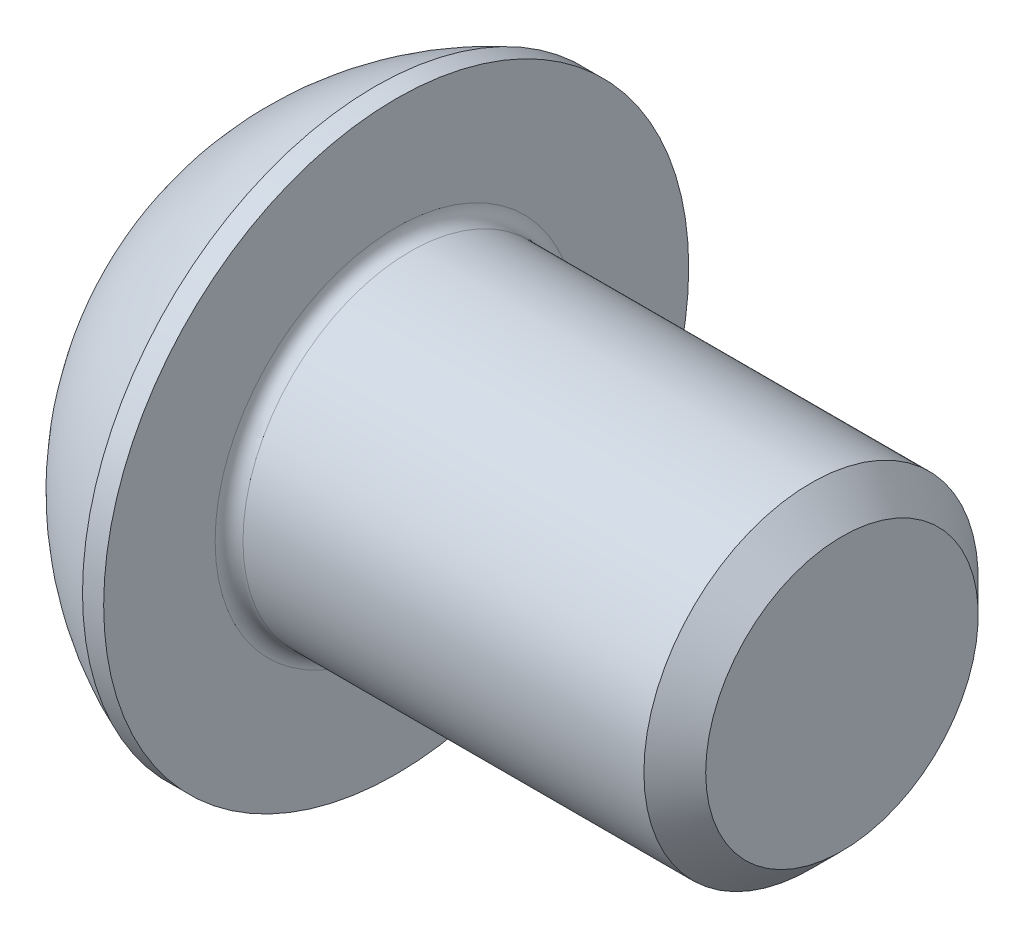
ISO-10303-21;
HEADER;
FILE_DESCRIPTION(('STEP AP214'),'2;1');
FILE_NAME('part.step','',(''),(''),'','','');
FILE_SCHEMA(('AUTOMOTIVE_DESIGN { 1 0 10303 214 1 1 1 1 }'));
ENDSEC;
DATA;
#1=APPLICATION_CONTEXT('core data for automotive mechanical design processes');
#2=APPLICATION_PROTOCOL_DEFINITION('international standard','automotive_design',2000,#1);
#3=PRODUCT_CONTEXT('',#1,'mechanical');
#4=PRODUCT('Part','Part','',(#3));
#5=PRODUCT_RELATED_PRODUCT_CATEGORY('part','',(#4));
#6=PRODUCT_DEFINITION_FORMATION('','',#4);
#7=PRODUCT_DEFINITION_CONTEXT('part definition',#1,'design');
#8=PRODUCT_DEFINITION('design','',#6,#7);
#9=PRODUCT_DEFINITION_SHAPE('','',#8);
#10=(LENGTH_UNIT() NAMED_UNIT(*) SI_UNIT(.MILLI.,.METRE.));
#11=(NAMED_UNIT(*) PLANE_ANGLE_UNIT() SI_UNIT($,.RADIAN.));
#12=(NAMED_UNIT(*) SI_UNIT($,.STERADIAN.) SOLID_ANGLE_UNIT());
#13=UNCERTAINTY_MEASURE_WITH_UNIT(LENGTH_MEASURE(1.E-05),#10,'distance_accuracy_value','');
#14=(GEOMETRIC_REPRESENTATION_CONTEXT(3) GLOBAL_UNCERTAINTY_ASSIGNED_CONTEXT((#13)) GLOBAL_UNIT_ASSIGNED_CONTEXT((#10,
#11,#12)) REPRESENTATION_CONTEXT('',''));
#15=CARTESIAN_POINT('',(0.,0.,0.));
#16=DIRECTION('',(0.,0.,1.));
#17=DIRECTION('',(1.,0.,0.));
#18=AXIS2_PLACEMENT_3D('',#15,#16,#17);
#19=CARTESIAN_POINT('',(0.,0.,0.));
#20=DIRECTION('',(-1.,0.,0.));
#21=DIRECTION('',(0.,0.,1.));
#22=AXIS2_PLACEMENT_3D('',#19,#20,#21);
#23=PLANE('',#22);
#24=CARTESIAN_POINT('',(0.,0.,0.));
#25=DIRECTION('',(-1.,0.,0.));
#26=DIRECTION('',(0.,0.,1.));
#27=AXIS2_PLACEMENT_3D('',#24,#25,#26);
#28=CIRCLE('',#27,2.625);
#29=CARTESIAN_POINT('',(0.,2.625,0.));
#30=VERTEX_POINT('',#29);
#31=EDGE_CURVE('E144',#30,#30,#28,.T.);
#32=ORIENTED_EDGE('',*,*,#31,.T.);
#33=EDGE_LOOP('',(#32));
#34=FACE_BOUND('',#33,.T.);
#35=DIRECTION('',(0.,0.5,-0.866025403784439));
#36=VECTOR('',#35,1.);
#37=CARTESIAN_POINT('',(0.,-1.15470053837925,-2.));
#38=LINE('',#37,#36);
#39=CARTESIAN_POINT('',(0.,-2.3094010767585,0.));
#40=VERTEX_POINT('',#39);
#41=CARTESIAN_POINT('',(0.,-1.15470053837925,-2.));
#42=VERTEX_POINT('',#41);
#43=EDGE_CURVE('E102',#40,#42,#38,.T.);
#44=ORIENTED_EDGE('',*,*,#43,.T.);
#45=DIRECTION('',(0.,1.,0.));
#46=VECTOR('',#45,1.);
#47=CARTESIAN_POINT('',(0.,1.15470053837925,-2.));
#48=LINE('',#47,#46);
#49=CARTESIAN_POINT('',(0.,1.15470053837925,-2.));
#50=VERTEX_POINT('',#49);
#51=EDGE_CURVE('E114',#42,#50,#48,.T.);
#52=ORIENTED_EDGE('',*,*,#51,.T.);
#53=DIRECTION('',(0.,0.5,0.866025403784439));
#54=VECTOR('',#53,1.);
#55=CARTESIAN_POINT('',(0.,2.3094010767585,0.));
#56=LINE('',#55,#54);
#57=CARTESIAN_POINT('',(0.,2.3094010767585,0.));
#58=VERTEX_POINT('',#57);
#59=EDGE_CURVE('E380',#50,#58,#56,.T.);
#60=ORIENTED_EDGE('',*,*,#59,.T.);
#61=DIRECTION('',(0.,-0.5,0.866025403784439));
#62=VECTOR('',#61,1.);
#63=CARTESIAN_POINT('',(0.,1.15470053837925,2.));
#64=LINE('',#63,#62);
#65=CARTESIAN_POINT('',(0.,1.15470053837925,2.));
#66=VERTEX_POINT('',#65);
#67=EDGE_CURVE('E383',#58,#66,#64,.T.);
#68=ORIENTED_EDGE('',*,*,#67,.T.);
#69=DIRECTION('',(0.,-1.,0.));
#70=VECTOR('',#69,1.);
#71=CARTESIAN_POINT('',(0.,-1.15470053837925,2.));
#72=LINE('',#71,#70);
#73=CARTESIAN_POINT('',(0.,-1.15470053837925,2.));
#74=VERTEX_POINT('',#73);
#75=EDGE_CURVE('E43',#66,#74,#72,.T.);
#76=ORIENTED_EDGE('',*,*,#75,.T.);
#77=DIRECTION('',(0.,-0.5,-0.866025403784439));
#78=VECTOR('',#77,1.);
#79=CARTESIAN_POINT('',(0.,-2.3094010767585,0.));
#80=LINE('',#79,#78);
#81=EDGE_CURVE('E100',#74,#40,#80,.T.);
#82=ORIENTED_EDGE('',*,*,#81,.T.);
#83=EDGE_LOOP('',(#44,#52,#60,#68,#76,#82));
#84=FACE_BOUND('',#83,.T.);
#85=ADVANCED_FACE('F29',(#34,#84),#23,.T.);
#86=CARTESIAN_POINT('',(4.99970462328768,0.,0.));
#87=DIRECTION('',(-1.,0.,0.));
#88=DIRECTION('',(0.,1.,0.));
#89=AXIS2_PLACEMENT_3D('',#86,#87,#88);
#90=SPHERICAL_SURFACE('',#89,5.64691697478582);
#91=CARTESIAN_POINT('',(2.92,0.,0.));
#92=DIRECTION('',(-1.,0.,0.));
#93=DIRECTION('',(0.,0.,1.));
#94=AXIS2_PLACEMENT_3D('',#91,#92,#93);
#95=CIRCLE('',#94,5.25);
#96=CARTESIAN_POINT('',(2.92,5.25,0.));
#97=VERTEX_POINT('',#96);
#98=EDGE_CURVE('E141',#97,#97,#95,.T.);
#99=CARTESIAN_POINT('',(2.92,5.25,0.));
#100=CARTESIAN_POINT('',(2.88116333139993,5.23461555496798,0.));
#101=CARTESIAN_POINT('',(2.84249743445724,5.21880002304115,0.));
#102=CARTESIAN_POINT('',(2.76552608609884,5.18631490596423,0.));
#103=CARTESIAN_POINT('',(2.72722063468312,5.16964532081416,0.));
#104=CARTESIAN_POINT('',(2.65098907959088,5.13546021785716,0.));
#105=CARTESIAN_POINT('',(2.61306297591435,5.11794470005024,0.));
#106=CARTESIAN_POINT('',(2.5376087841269,5.08207638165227,0.));
#107=CARTESIAN_POINT('',(2.50008069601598,5.06372358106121,0.));
#108=CARTESIAN_POINT('',(2.42544101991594,5.02618972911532,0.));
#109=CARTESIAN_POINT('',(2.38832943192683,5.00700867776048,0.));
#110=CARTESIAN_POINT('',(2.31454103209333,4.9678277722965,0.));
#111=CARTESIAN_POINT('',(2.27786422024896,4.94782791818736,0.));
#112=CARTESIAN_POINT('',(2.204963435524,4.90701925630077,0.));
#113=CARTESIAN_POINT('',(2.16873946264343,4.88621044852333,0.));
#114=CARTESIAN_POINT('',(2.09676219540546,4.84379412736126,0.));
#115=CARTESIAN_POINT('',(2.06100890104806,4.82218661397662,0.));
#116=CARTESIAN_POINT('',(1.9899905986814,4.77818352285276,0.));
#117=CARTESIAN_POINT('',(1.95472559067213,4.75578794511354,0.));
#118=CARTESIAN_POINT('',(1.88470122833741,4.71021975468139,0.));
#119=CARTESIAN_POINT('',(1.84994187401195,4.68704714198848,0.));
#120=CARTESIAN_POINT('',(1.78094593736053,4.63993629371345,0.));
#121=CARTESIAN_POINT('',(1.74670935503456,4.61599805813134,0.));
#122=CARTESIAN_POINT('',(1.67877582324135,4.56736775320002,0.));
#123=CARTESIAN_POINT('',(1.6450788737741,4.54267568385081,0.));
#124=CARTESIAN_POINT('',(1.57824120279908,4.4925498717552,0.));
#125=CARTESIAN_POINT('',(1.54510048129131,4.4671161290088,0.));
#126=CARTESIAN_POINT('',(1.47939158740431,4.4155194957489,0.));
#127=CARTESIAN_POINT('',(1.44682341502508,4.38935660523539,0.));
#128=CARTESIAN_POINT('',(1.3822756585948,4.33631456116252,0.));
#129=CARTESIAN_POINT('',(1.35029607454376,4.30943540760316,0.));
#130=CARTESIAN_POINT('',(1.28694124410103,4.2549740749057,0.));
#131=CARTESIAN_POINT('',(1.25556599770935,4.22739189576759,0.));
#132=CARTESIAN_POINT('',(1.19343529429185,4.17153809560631,0.));
#133=CARTESIAN_POINT('',(1.16267983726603,4.14326647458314,0.));
#134=CARTESIAN_POINT('',(1.10180385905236,4.0860477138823,0.));
#135=CARTESIAN_POINT('',(1.07168333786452,4.05710057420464,0.));
#136=CARTESIAN_POINT('',(1.01209206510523,3.99854503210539,0.));
#137=CARTESIAN_POINT('',(0.98262131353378,3.96893662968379,0.));
#138=CARTESIAN_POINT('',(0.924344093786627,3.90907314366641,0.));
#139=CARTESIAN_POINT('',(0.89553762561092,3.87881806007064,0.));
#140=CARTESIAN_POINT('',(0.838603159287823,3.8176761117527,0.));
#141=CARTESIAN_POINT('',(0.810475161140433,3.78678924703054,0.));
#142=CARTESIAN_POINT('',(0.754911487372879,3.72439894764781,0.));
#143=CARTESIAN_POINT('',(0.727475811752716,3.69289551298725,0.));
#144=CARTESIAN_POINT('',(0.673310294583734,3.62928758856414,0.));
#145=CARTESIAN_POINT('',(0.646580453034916,3.59718309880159,0.));
#146=CARTESIAN_POINT('',(0.593839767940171,3.53238887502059,0.));
#147=CARTESIAN_POINT('',(0.567828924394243,3.49969914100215,0.));
#148=CARTESIAN_POINT('',(0.516539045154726,3.43375052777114,0.));
#149=CARTESIAN_POINT('',(0.491260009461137,3.40049164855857,0.));
#150=CARTESIAN_POINT('',(0.441446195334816,3.33342112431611,0.));
#151=CARTESIAN_POINT('',(0.416911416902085,3.29960947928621,0.));
#152=CARTESIAN_POINT('',(0.368598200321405,3.23145007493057,0.));
#153=CARTESIAN_POINT('',(0.344819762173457,3.19710231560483,0.));
#154=CARTESIAN_POINT('',(0.298030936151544,3.12788759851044,0.));
#155=CARTESIAN_POINT('',(0.275020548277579,3.0930206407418,0.));
#156=CARTESIAN_POINT('',(0.229779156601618,3.02278469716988,0.));
#157=CARTESIAN_POINT('',(0.207548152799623,2.98741571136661,0.));
#158=CARTESIAN_POINT('',(0.163876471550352,2.91619313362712,0.));
#159=CARTESIAN_POINT('',(0.142435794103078,2.8803395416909,0.));
#160=CARTESIAN_POINT('',(0.100355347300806,2.80816539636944,0.));
#161=CARTESIAN_POINT('',(0.079715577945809,2.7718448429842,0.));
#162=CARTESIAN_POINT('',(0.0392470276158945,2.69875470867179,0.));
#163=CARTESIAN_POINT('',(0.0194182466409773,2.66198512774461,0.));
#164=CARTESIAN_POINT('',(0.,2.625,0.));
#165=B_SPLINE_CURVE_WITH_KNOTS('',3,(#99,#100,#101,#102,#103,#104,#105,#106,#107,#108,#109,#110,
#111,#112,#113,#114,#115,#116,#117,#118,#119,#120,#121,#122,#123,#124,#125,#126,#127,#128,#129,
#130,#131,#132,#133,#134,#135,#136,#137,#138,#139,#140,#141,#142,#143,#144,#145,#146,#147,#148,
#149,#150,#151,#152,#153,#154,#155,#156,#157,#158,#159,#160,#161,#162,#163,#164),.UNSPECIFIED.,
.F.,.F.,(4,2,2,2,2,2,2,2,2,2,2,2,2,2,2,2,2,2,2,2,2,2,2,2,2,2,2,2,2,2,2,2,4),(0.,
0.12531586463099,0.250631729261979,0.375947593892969,0.501263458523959,0.626579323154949,
0.751895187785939,0.877211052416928,1.00252691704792,1.12784278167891,1.2531586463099,
1.37847451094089,1.50379037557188,1.62910624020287,1.75442210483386,1.87973796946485,
2.00505383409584,2.13036969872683,2.25568556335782,2.38100142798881,2.5063172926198,
2.63163315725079,2.75694902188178,2.88226488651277,3.00758075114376,3.13289661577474,
3.25821248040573,3.38352834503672,3.50884420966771,3.6341600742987,3.75947593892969,
3.88479180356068,4.01010766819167),.UNSPECIFIED.);
#166=EDGE_CURVE('BSEAM168',#97,#30,#165,.T.);
#167=ORIENTED_EDGE('',*,*,#98,.T.);
#168=ORIENTED_EDGE('',*,*,#31,.F.);
#169=ORIENTED_EDGE('',*,*,#166,.T.);
#170=ORIENTED_EDGE('',*,*,#166,.F.);
#171=EDGE_LOOP('',(#167,#169,#168,#170));
#172=FACE_BOUND('',#171,.T.);
#173=ADVANCED_FACE('F168',(#172),#90,.T.);
#174=CARTESIAN_POINT('',(0.,0.,0.));
#175=DIRECTION('',(-1.,0.,0.));
#176=DIRECTION('',(0.,0.,1.));
#177=AXIS2_PLACEMENT_3D('',#174,#175,#176);
#178=CYLINDRICAL_SURFACE('',#177,5.25);
#179=ORIENTED_EDGE('',*,*,#98,.F.);
#180=EDGE_LOOP('',(#179));
#181=FACE_BOUND('',#180,.T.);
#182=CARTESIAN_POINT('',(3.3,0.,0.));
#183=DIRECTION('',(-1.,0.,0.));
#184=DIRECTION('',(0.,0.,1.));
#185=AXIS2_PLACEMENT_3D('',#182,#183,#184);
#186=CIRCLE('',#185,5.25);
#187=CARTESIAN_POINT('',(3.3,0.,5.25));
#188=VERTEX_POINT('',#187);
#189=EDGE_CURVE('E138',#188,#188,#186,.T.);
#190=ORIENTED_EDGE('',*,*,#189,.T.);
#191=EDGE_LOOP('',(#190));
#192=FACE_BOUND('',#191,.T.);
#193=ADVANCED_FACE('F173',(#181,#192),#178,.T.);
#194=CARTESIAN_POINT('',(3.3,2.99999999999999,0.));
#195=DIRECTION('',(-1.,0.,0.));
#196=DIRECTION('',(0.,0.,1.));
#197=AXIS2_PLACEMENT_3D('',#194,#195,#196);
#198=PLANE('',#197);
#199=CARTESIAN_POINT('',(3.3,0.,0.));
#200=DIRECTION('',(-1.,0.,0.));
#201=DIRECTION('',(0.,0.,1.));
#202=AXIS2_PLACEMENT_3D('',#199,#200,#201);
#203=CIRCLE('',#202,3.24999999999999);
#204=CARTESIAN_POINT('',(3.3,0.,3.24999999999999));
#205=VERTEX_POINT('',#204);
#206=EDGE_CURVE('E36',#205,#205,#203,.T.);
#207=ORIENTED_EDGE('',*,*,#206,.T.);
#208=EDGE_LOOP('',(#207));
#209=FACE_BOUND('',#208,.T.);
#210=ORIENTED_EDGE('',*,*,#189,.F.);
#211=EDGE_LOOP('',(#210));
#212=FACE_BOUND('',#211,.T.);
#213=ADVANCED_FACE('F149',(#209,#212),#198,.F.);
#214=CARTESIAN_POINT('',(0.,0.,0.));
#215=DIRECTION('',(-1.,0.,0.));
#216=DIRECTION('',(0.,0.,1.));
#217=AXIS2_PLACEMENT_3D('',#214,#215,#216);
#218=CYLINDRICAL_SURFACE('',#217,2.99999999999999);
#219=CARTESIAN_POINT('',(3.55,0.,0.));
#220=DIRECTION('',(-1.,0.,0.));
#221=DIRECTION('',(0.,0.,1.));
#222=AXIS2_PLACEMENT_3D('',#219,#220,#221);
#223=CIRCLE('',#222,2.99999999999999);
#224=CARTESIAN_POINT('',(3.55,0.,2.99999999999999));
#225=VERTEX_POINT('',#224);
#226=EDGE_CURVE('E11',#225,#225,#223,.F.);
#227=ORIENTED_EDGE('',*,*,#226,.T.);
#228=EDGE_LOOP('',(#227));
#229=FACE_BOUND('',#228,.T.);
#230=CARTESIAN_POINT('',(10.7455,0.,0.));
#231=DIRECTION('',(-1.,0.,0.));
#232=DIRECTION('',(0.,0.,1.));
#233=AXIS2_PLACEMENT_3D('',#230,#231,#232);
#234=CIRCLE('',#233,2.99999999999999);
#235=CARTESIAN_POINT('',(10.7455,0.,2.99999999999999));
#236=VERTEX_POINT('',#235);
#237=EDGE_CURVE('E135',#236,#236,#234,.T.);
#238=ORIENTED_EDGE('',*,*,#237,.T.);
#239=EDGE_LOOP('',(#238));
#240=FACE_BOUND('',#239,.T.);
#241=ADVANCED_FACE('F185',(#229,#240),#218,.T.);
#242=CARTESIAN_POINT('',(11.3,0.,0.));
#243=DIRECTION('',(-1.,0.,0.));
#244=DIRECTION('',(0.,0.,1.));
#245=AXIS2_PLACEMENT_3D('',#242,#243,#244);
#246=CONICAL_SURFACE('',#245,2.4455,0.785398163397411);
#247=ORIENTED_EDGE('',*,*,#237,.F.);
#248=EDGE_LOOP('',(#247));
#249=FACE_BOUND('',#248,.T.);
#250=CARTESIAN_POINT('',(11.3,0.,0.));
#251=DIRECTION('',(-1.,0.,0.));
#252=DIRECTION('',(0.,0.,1.));
#253=AXIS2_PLACEMENT_3D('',#250,#251,#252);
#254=CIRCLE('',#253,2.4455);
#255=CARTESIAN_POINT('',(11.3,0.,2.4455));
#256=VERTEX_POINT('',#255);
#257=EDGE_CURVE('E131',#256,#256,#254,.T.);
#258=ORIENTED_EDGE('',*,*,#257,.T.);
#259=EDGE_LOOP('',(#258));
#260=FACE_BOUND('',#259,.T.);
#261=ADVANCED_FACE('F162',(#249,#260),#246,.T.);
#262=CARTESIAN_POINT('',(11.3,0.,0.));
#263=DIRECTION('',(-1.,0.,0.));
#264=DIRECTION('',(0.,0.,1.));
#265=AXIS2_PLACEMENT_3D('',#262,#263,#264);
#266=PLANE('',#265);
#267=ORIENTED_EDGE('',*,*,#257,.F.);
#268=EDGE_LOOP('',(#267));
#269=FACE_BOUND('',#268,.T.);
#270=ADVANCED_FACE('F154',(#269),#266,.F.);
#271=CARTESIAN_POINT('',(3.55,0.,0.));
#272=DIRECTION('',(-1.,0.,0.));
#273=DIRECTION('',(0.,0.,1.));
#274=AXIS2_PLACEMENT_3D('',#271,#272,#273);
#275=TOROIDAL_SURFACE('',#274,3.24999999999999,0.25);
#276=ORIENTED_EDGE('',*,*,#226,.F.);
#277=EDGE_LOOP('',(#276));
#278=FACE_BOUND('',#277,.T.);
#279=ORIENTED_EDGE('',*,*,#206,.F.);
#280=EDGE_LOOP('',(#279));
#281=FACE_BOUND('',#280,.T.);
#282=ADVANCED_FACE('F152',(#278,#281),#275,.F.);
#283=CARTESIAN_POINT('',(2.08,-2.3094010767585,0.));
#284=DIRECTION('',(0.,0.866025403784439,-0.5));
#285=DIRECTION('',(0.,0.5,0.866025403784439));
#286=AXIS2_PLACEMENT_3D('',#283,#284,#285);
#287=PLANE('',#286);
#288=DIRECTION('',(0.,-0.5,-0.866025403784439));
#289=VECTOR('',#288,1.);
#290=CARTESIAN_POINT('',(2.08,-2.3094010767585,0.));
#291=LINE('',#290,#289);
#292=CARTESIAN_POINT('',(2.08,-1.15470053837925,2.));
#293=VERTEX_POINT('',#292);
#294=CARTESIAN_POINT('',(2.08,-1.73205080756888,1.));
#295=VERTEX_POINT('',#294);
#296=EDGE_CURVE('E358',#293,#295,#291,.T.);
#297=ORIENTED_EDGE('',*,*,#296,.T.);
#298=CARTESIAN_POINT('',(2.08,-2.3094010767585,0.));
#299=VERTEX_POINT('',#298);
#300=EDGE_CURVE('E119',#295,#299,#291,.T.);
#301=ORIENTED_EDGE('',*,*,#300,.T.);
#302=DIRECTION('',(-1.,0.,0.));
#303=VECTOR('',#302,1.);
#304=CARTESIAN_POINT('',(2.08,-2.3094010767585,0.));
#305=LINE('',#304,#303);
#306=EDGE_CURVE('E110',#299,#40,#305,.T.);
#307=ORIENTED_EDGE('',*,*,#306,.T.);
#308=ORIENTED_EDGE('',*,*,#81,.F.);
#309=DIRECTION('',(-1.,0.,0.));
#310=VECTOR('',#309,1.);
#311=CARTESIAN_POINT('',(2.08,-1.15470053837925,2.));
#312=LINE('',#311,#310);
#313=EDGE_CURVE('E364',#293,#74,#312,.T.);
#314=ORIENTED_EDGE('',*,*,#313,.F.);
#315=EDGE_LOOP('',(#297,#301,#307,#308,#314));
#316=FACE_BOUND('',#315,.T.);
#317=ADVANCED_FACE('F117',(#316),#287,.T.);
#318=CARTESIAN_POINT('',(2.08,-1.15470053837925,-2.));
#319=DIRECTION('',(0.,0.866025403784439,0.5));
#320=DIRECTION('',(0.,-0.5,0.866025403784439));
#321=AXIS2_PLACEMENT_3D('',#318,#319,#320);
#322=PLANE('',#321);
#323=DIRECTION('',(0.,0.5,-0.866025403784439));
#324=VECTOR('',#323,1.);
#325=CARTESIAN_POINT('',(2.08,-1.15470053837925,-2.));
#326=LINE('',#325,#324);
#327=CARTESIAN_POINT('',(2.08,-1.73205080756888,-1.));
#328=VERTEX_POINT('',#327);
#329=EDGE_CURVE('E51',#299,#328,#326,.T.);
#330=ORIENTED_EDGE('',*,*,#329,.T.);
#331=CARTESIAN_POINT('',(2.08,-1.15470053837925,-2.));
#332=VERTEX_POINT('',#331);
#333=EDGE_CURVE('E390',#328,#332,#326,.T.);
#334=ORIENTED_EDGE('',*,*,#333,.T.);
#335=DIRECTION('',(-1.,0.,0.));
#336=VECTOR('',#335,1.);
#337=CARTESIAN_POINT('',(2.08,-1.15470053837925,-2.));
#338=LINE('',#337,#336);
#339=EDGE_CURVE('E112',#332,#42,#338,.T.);
#340=ORIENTED_EDGE('',*,*,#339,.T.);
#341=ORIENTED_EDGE('',*,*,#43,.F.);
#342=ORIENTED_EDGE('',*,*,#306,.F.);
#343=EDGE_LOOP('',(#330,#334,#340,#341,#342));
#344=FACE_BOUND('',#343,.T.);
#345=ADVANCED_FACE('F109',(#344),#322,.T.);
#346=CARTESIAN_POINT('',(2.08,1.15470053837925,-2.));
#347=DIRECTION('',(0.,0.,1.));
#348=DIRECTION('',(0.,-1.,0.));
#349=AXIS2_PLACEMENT_3D('',#346,#347,#348);
#350=PLANE('',#349);
#351=DIRECTION('',(0.,1.,0.));
#352=VECTOR('',#351,1.);
#353=CARTESIAN_POINT('',(2.08,1.15470053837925,-2.));
#354=LINE('',#353,#352);
#355=CARTESIAN_POINT('',(2.08,0.,-2.));
#356=VERTEX_POINT('',#355);
#357=EDGE_CURVE('E392',#332,#356,#354,.T.);
#358=ORIENTED_EDGE('',*,*,#357,.T.);
#359=CARTESIAN_POINT('',(2.08,1.15470053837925,-2.));
#360=VERTEX_POINT('',#359);
#361=EDGE_CURVE('E377',#356,#360,#354,.T.);
#362=ORIENTED_EDGE('',*,*,#361,.T.);
#363=DIRECTION('',(-1.,0.,0.));
#364=VECTOR('',#363,1.);
#365=CARTESIAN_POINT('',(2.08,1.15470053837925,-2.));
#366=LINE('',#365,#364);
#367=EDGE_CURVE('E126',#360,#50,#366,.T.);
#368=ORIENTED_EDGE('',*,*,#367,.T.);
#369=ORIENTED_EDGE('',*,*,#51,.F.);
#370=ORIENTED_EDGE('',*,*,#339,.F.);
#371=EDGE_LOOP('',(#358,#362,#368,#369,#370));
#372=FACE_BOUND('',#371,.T.);
#373=ADVANCED_FACE('F239',(#372),#350,.T.);
#374=CARTESIAN_POINT('',(2.08,2.3094010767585,0.));
#375=DIRECTION('',(0.,-0.866025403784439,0.5));
#376=DIRECTION('',(0.,-0.5,-0.866025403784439));
#377=AXIS2_PLACEMENT_3D('',#374,#375,#376);
#378=PLANE('',#377);
#379=DIRECTION('',(0.,0.5,0.866025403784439));
#380=VECTOR('',#379,1.);
#381=CARTESIAN_POINT('',(2.08,2.3094010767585,0.));
#382=LINE('',#381,#380);
#383=CARTESIAN_POINT('',(2.08,1.73205080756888,-1.));
#384=VERTEX_POINT('',#383);
#385=EDGE_CURVE('E394',#360,#384,#382,.T.);
#386=ORIENTED_EDGE('',*,*,#385,.T.);
#387=CARTESIAN_POINT('',(2.08,2.3094010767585,0.));
#388=VERTEX_POINT('',#387);
#389=EDGE_CURVE('E393',#384,#388,#382,.T.);
#390=ORIENTED_EDGE('',*,*,#389,.T.);
#391=DIRECTION('',(-1.,0.,0.));
#392=VECTOR('',#391,1.);
#393=CARTESIAN_POINT('',(2.08,2.3094010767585,0.));
#394=LINE('',#393,#392);
#395=EDGE_CURVE('E370',#388,#58,#394,.T.);
#396=ORIENTED_EDGE('',*,*,#395,.T.);
#397=ORIENTED_EDGE('',*,*,#59,.F.);
#398=ORIENTED_EDGE('',*,*,#367,.F.);
#399=EDGE_LOOP('',(#386,#390,#396,#397,#398));
#400=FACE_BOUND('',#399,.T.);
#401=ADVANCED_FACE('F248',(#400),#378,.T.);
#402=CARTESIAN_POINT('',(2.08,1.15470053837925,2.));
#403=DIRECTION('',(0.,-0.866025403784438,-0.5));
#404=DIRECTION('',(0.,0.5,-0.866025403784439));
#405=AXIS2_PLACEMENT_3D('',#402,#403,#404);
#406=PLANE('',#405);
#407=DIRECTION('',(0.,-0.5,0.866025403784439));
#408=VECTOR('',#407,1.);
#409=CARTESIAN_POINT('',(2.08,1.15470053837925,2.));
#410=LINE('',#409,#408);
#411=CARTESIAN_POINT('',(2.08,1.73205080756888,1.));
#412=VERTEX_POINT('',#411);
#413=EDGE_CURVE('E359',#388,#412,#410,.T.);
#414=ORIENTED_EDGE('',*,*,#413,.T.);
#415=CARTESIAN_POINT('',(2.08,1.15470053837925,2.));
#416=VERTEX_POINT('',#415);
#417=EDGE_CURVE('E354',#412,#416,#410,.T.);
#418=ORIENTED_EDGE('',*,*,#417,.T.);
#419=DIRECTION('',(-1.,0.,0.));
#420=VECTOR('',#419,1.);
#421=CARTESIAN_POINT('',(2.08,1.15470053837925,2.));
#422=LINE('',#421,#420);
#423=EDGE_CURVE('E363',#416,#66,#422,.T.);
#424=ORIENTED_EDGE('',*,*,#423,.T.);
#425=ORIENTED_EDGE('',*,*,#67,.F.);
#426=ORIENTED_EDGE('',*,*,#395,.F.);
#427=EDGE_LOOP('',(#414,#418,#424,#425,#426));
#428=FACE_BOUND('',#427,.T.);
#429=ADVANCED_FACE('F258',(#428),#406,.T.);
#430=CARTESIAN_POINT('',(2.08,-3.46410161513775,-2.));
#431=DIRECTION('',(1.,0.,0.));
#432=DIRECTION('',(0.,0.,-1.));
#433=AXIS2_PLACEMENT_3D('',#430,#431,#432);
#434=PLANE('',#433);
#435=CARTESIAN_POINT('',(2.08,0.,0.));
#436=DIRECTION('',(-1.,0.,0.));
#437=DIRECTION('',(0.,0.,1.));
#438=AXIS2_PLACEMENT_3D('',#435,#436,#437);
#439=CIRCLE('',#438,2.);
#440=EDGE_CURVE('E397',#384,#356,#439,.T.);
#441=ORIENTED_EDGE('',*,*,#440,.F.);
#442=ORIENTED_EDGE('',*,*,#385,.F.);
#443=ORIENTED_EDGE('',*,*,#361,.F.);
#444=EDGE_LOOP('',(#441,#442,#443));
#445=FACE_BOUND('',#444,.T.);
#446=ADVANCED_FACE('F268',(#445),#434,.F.);
#447=EDGE_CURVE('E132',#412,#384,#439,.T.);
#448=ORIENTED_EDGE('',*,*,#447,.F.);
#449=ORIENTED_EDGE('',*,*,#413,.F.);
#450=ORIENTED_EDGE('',*,*,#389,.F.);
#451=EDGE_LOOP('',(#448,#449,#450));
#452=FACE_BOUND('',#451,.T.);
#453=ADVANCED_FACE('F278',(#452),#434,.F.);
#454=CARTESIAN_POINT('',(2.08,0.,2.));
#455=VERTEX_POINT('',#454);
#456=EDGE_CURVE('E125',#455,#412,#439,.T.);
#457=ORIENTED_EDGE('',*,*,#456,.F.);
#458=DIRECTION('',(0.,-1.,0.));
#459=VECTOR('',#458,1.);
#460=CARTESIAN_POINT('',(2.08,-1.15470053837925,2.));
#461=LINE('',#460,#459);
#462=EDGE_CURVE('E353',#416,#455,#461,.T.);
#463=ORIENTED_EDGE('',*,*,#462,.F.);
#464=ORIENTED_EDGE('',*,*,#417,.F.);
#465=EDGE_LOOP('',(#457,#463,#464));
#466=FACE_BOUND('',#465,.T.);
#467=ADVANCED_FACE('F289',(#466),#434,.F.);
#468=EDGE_CURVE('E120',#295,#455,#439,.T.);
#469=ORIENTED_EDGE('',*,*,#468,.F.);
#470=ORIENTED_EDGE('',*,*,#296,.F.);
#471=EDGE_CURVE('E357',#455,#293,#461,.T.);
#472=ORIENTED_EDGE('',*,*,#471,.F.);
#473=EDGE_LOOP('',(#469,#470,#472));
#474=FACE_BOUND('',#473,.T.);
#475=ADVANCED_FACE('F298',(#474),#434,.F.);
#476=EDGE_CURVE('E123',#328,#295,#439,.T.);
#477=ORIENTED_EDGE('',*,*,#476,.F.);
#478=ORIENTED_EDGE('',*,*,#329,.F.);
#479=ORIENTED_EDGE('',*,*,#300,.F.);
#480=EDGE_LOOP('',(#477,#478,#479));
#481=FACE_BOUND('',#480,.T.);
#482=ADVANCED_FACE('F307',(#481),#434,.F.);
#483=CARTESIAN_POINT('',(2.08,-1.15470053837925,2.));
#484=DIRECTION('',(0.,0.,-1.));
#485=DIRECTION('',(0.,1.,0.));
#486=AXIS2_PLACEMENT_3D('',#483,#484,#485);
#487=PLANE('',#486);
#488=ORIENTED_EDGE('',*,*,#462,.T.);
#489=ORIENTED_EDGE('',*,*,#471,.T.);
#490=ORIENTED_EDGE('',*,*,#313,.T.);
#491=ORIENTED_EDGE('',*,*,#75,.F.);
#492=ORIENTED_EDGE('',*,*,#423,.F.);
#493=EDGE_LOOP('',(#488,#489,#490,#491,#492));
#494=FACE_BOUND('',#493,.T.);
#495=ADVANCED_FACE('F316',(#494),#487,.T.);
#496=EDGE_CURVE('E398',#356,#328,#439,.T.);
#497=ORIENTED_EDGE('',*,*,#496,.F.);
#498=ORIENTED_EDGE('',*,*,#357,.F.);
#499=ORIENTED_EDGE('',*,*,#333,.F.);
#500=EDGE_LOOP('',(#497,#498,#499));
#501=FACE_BOUND('',#500,.T.);
#502=ADVANCED_FACE('F281',(#501),#434,.F.);
#503=CARTESIAN_POINT('',(3.23470053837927,0.,0.));
#504=DIRECTION('',(-1.,0.,0.));
#505=DIRECTION('',(0.,0.,1.));
#506=AXIS2_PLACEMENT_3D('',#503,#504,#505);
#507=CONICAL_SURFACE('',#506,0.,1.04719755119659);
#508=ORIENTED_EDGE('',*,*,#456,.T.);
#509=ORIENTED_EDGE('',*,*,#447,.T.);
#510=ORIENTED_EDGE('',*,*,#440,.T.);
#511=ORIENTED_EDGE('',*,*,#496,.T.);
#512=ORIENTED_EDGE('',*,*,#476,.T.);
#513=ORIENTED_EDGE('',*,*,#468,.T.);
#514=EDGE_LOOP('',(#508,#509,#510,#511,#512,#513));
#515=FACE_BOUND('',#514,.T.);
#516=CARTESIAN_POINT('',(3.23470053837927,0.,0.));
#517=VERTEX_POINT('',#516);
#518=VERTEX_LOOP('',#517);
#519=FACE_BOUND('',#518,.T.);
#520=ADVANCED_FACE('F334',(#515,#519),#507,.F.);
#521=CLOSED_SHELL('',(#85,#173,#193,#213,#241,#261,#270,#282,#317,#345,#373,#401,#429,#446,#453,
#467,#475,#482,#495,#502,#520));
#522=MANIFOLD_SOLID_BREP('B2',#521);
#523=ADVANCED_BREP_SHAPE_REPRESENTATION('',(#18,#522),#14);
#524=SHAPE_DEFINITION_REPRESENTATION(#9,#523);
ENDSEC;
END-ISO-10303-21;
